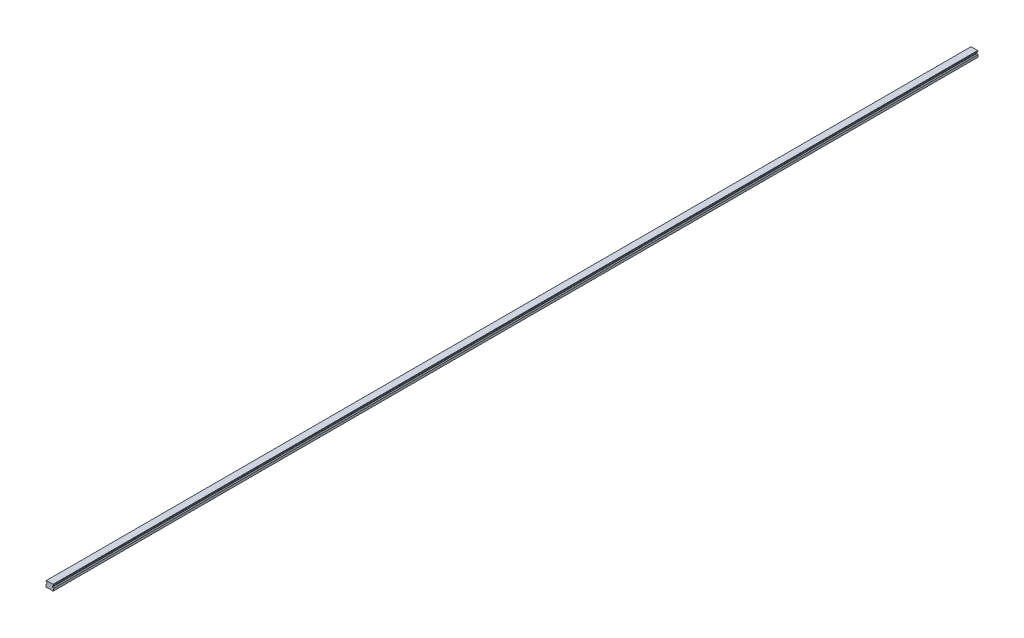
from build123d import *

# Parameters (mm, degrees)
SKETCH1_W           = 20
SKETCH1_H           = 16.3
BOSS_EXTRUDE1_DEPTH = 1250
CUT_EXTRUDE1_DEPTH  = 2501.07313693
CHAMFER1_SIZE       = 1
FILLET1_R           = 1
CUT_EXTRUDE2_DEPTH  = 2501.07313693
SKETCH5_R           = 3
SKETCH5_R_2         = 2.5
CUT_EXTRUDE5_DEPTH  = 10
SKETCH5_2_R         = 2.5
CUT_EXTRUDE6_DEPTH  = 13
LPATTERN2_COUNT     = 42
LPATTERN2_PITCH     = 60


with BuildPart() as part:
    # Sketch1 → Boss-Extrude1 (new, symmetric)
    with BuildSketch(Plane.XY):
        with Locations((0, 8.15)):
            Rectangle(SKETCH1_W, SKETCH1_H)
    extrude(amount=BOSS_EXTRUDE1_DEPTH, both=True)

    # Sketch2 → Cut-Extrude1 (cut, through all)
    with BuildSketch(Plane.XY.offset(1250)):
        Polygon((-10, 14.3), (-10, 7.3), (-7.666666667, 9.633333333), (-7.666666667, 11.966666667), align=None)
        Polygon((7.666666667, 11.966666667), (10, 14.3), (10, 7.3), (7.666666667, 9.633333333), align=None)
    extrude(amount=-CUT_EXTRUDE1_DEPTH, mode=Mode.SUBTRACT)

    # Chamfer1
    chamfer1_edges = [part.edges().sort_by_distance(p)[0] for p in [
        (-10, 16.3, 0),
        (10, 16.3, 0),
        (10, 0, 0),
        (-10, 0, 0),
    ]]
    chamfer(chamfer1_edges, length=CHAMFER1_SIZE)

    # Fillet1
    fillet1_edges = [part.edges().sort_by_distance(p)[0] for p in [
        (-7.666666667, 11.966666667, 0),
        (-7.666666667, 9.633333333, 0),
        (7.666666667, 9.633333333, 0),
        (7.666666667, 11.966666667, 0),
    ]]
    fillet(fillet1_edges, radius=FILLET1_R)

    # Sketch3 → Cut-Extrude2 (cut, through all)
    with BuildSketch(Plane.XY.offset(1250)):
        Polygon((-6, 0), (-5, 1), (5, 1), (6, 0), align=None)
    extrude(amount=-CUT_EXTRUDE2_DEPTH, mode=Mode.SUBTRACT)

    # Sketch5 → Cut-Extrude5 (cut)
    with BuildSketch(Plane.XZ.offset(-1)):
        with Locations(Location((0, 1230, 0), (0, 0, 270))):
            Circle(SKETCH5_R)
        with Locations(Location((0, 1230, 0), (0, 0, 270))):
            Circle(SKETCH5_R_2, mode=Mode.SUBTRACT)
    cut_extrude5 = extrude(amount=-CUT_EXTRUDE5_DEPTH, mode=Mode.SUBTRACT)

    # Sketch5_2 → Cut-Extrude6 (cut)
    with BuildSketch(Plane.XZ.offset(-1)):
        with Locations(Location((0, 1230, 0), (0, 0, 270))):
            Circle(SKETCH5_2_R)
    cut_extrude6 = extrude(amount=-CUT_EXTRUDE6_DEPTH, mode=Mode.SUBTRACT)

    # Cut-Extrude7 cone 1 section (on through the dimple's axis) → Cut-Extrude7 (revolve, cut)
    with BuildSketch(Plane(origin=(0, 14, 1230), x_dir=(0, 0, -1), z_dir=(1, 0, 0))):
        Polygon((0, 0), (2.5, 0), (0, 1.443375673), align=None)
    cut_extrude7 = revolve(axis=Axis((0, 14, 1230), (0, 1, 0)), mode=Mode.SUBTRACT)

    # LPattern2: Cut-Extrude5, Cut-Extrude6, Cut-Extrude7 ×42
    with Locations(*[(0, 0, -i * LPATTERN2_PITCH) for i in range(1, LPATTERN2_COUNT)]):
        add(cut_extrude5, mode=Mode.SUBTRACT)
        add(cut_extrude6, mode=Mode.SUBTRACT)
        add(cut_extrude7, mode=Mode.SUBTRACT)


solid = part.part
